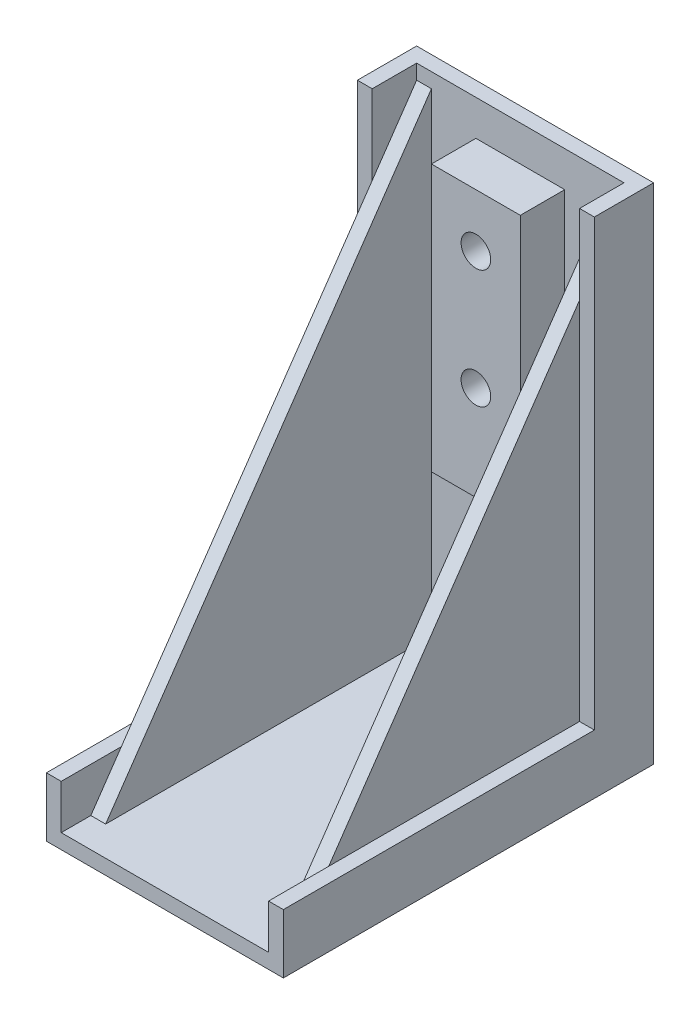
ISO-10303-21;
HEADER;
FILE_DESCRIPTION(('STEP AP214'),'2;1');
FILE_NAME('part.step','',(''),(''),'','','');
FILE_SCHEMA(('AUTOMOTIVE_DESIGN { 1 0 10303 214 1 1 1 1 }'));
ENDSEC;
DATA;
#1=APPLICATION_CONTEXT('core data for automotive mechanical design processes');
#2=APPLICATION_PROTOCOL_DEFINITION('international standard','automotive_design',2000,#1);
#3=PRODUCT_CONTEXT('',#1,'mechanical');
#4=PRODUCT('Part','Part','',(#3));
#5=PRODUCT_RELATED_PRODUCT_CATEGORY('part','',(#4));
#6=PRODUCT_DEFINITION_FORMATION('','',#4);
#7=PRODUCT_DEFINITION_CONTEXT('part definition',#1,'design');
#8=PRODUCT_DEFINITION('design','',#6,#7);
#9=PRODUCT_DEFINITION_SHAPE('','',#8);
#10=(LENGTH_UNIT() NAMED_UNIT(*) SI_UNIT(.MILLI.,.METRE.));
#11=(NAMED_UNIT(*) PLANE_ANGLE_UNIT() SI_UNIT($,.RADIAN.));
#12=(NAMED_UNIT(*) SI_UNIT($,.STERADIAN.) SOLID_ANGLE_UNIT());
#13=UNCERTAINTY_MEASURE_WITH_UNIT(LENGTH_MEASURE(1.E-05),#10,'distance_accuracy_value','');
#14=(GEOMETRIC_REPRESENTATION_CONTEXT(3) GLOBAL_UNCERTAINTY_ASSIGNED_CONTEXT((#13)) GLOBAL_UNIT_ASSIGNED_CONTEXT((#10,
#11,#12)) REPRESENTATION_CONTEXT('',''));
#15=CARTESIAN_POINT('',(0.,0.,0.));
#16=DIRECTION('',(0.,0.,1.));
#17=DIRECTION('',(1.,0.,0.));
#18=AXIS2_PLACEMENT_3D('',#15,#16,#17);
#19=CARTESIAN_POINT('',(8.75,41.25,0.));
#20=DIRECTION('',(0.,0.,-1.));
#21=DIRECTION('',(0.,1.,0.));
#22=AXIS2_PLACEMENT_3D('',#19,#20,#21);
#23=PLANE('',#22);
#24=DIRECTION('',(1.,0.,0.));
#25=VECTOR('',#24,1.);
#26=CARTESIAN_POINT('',(7.5,40.,0.));
#27=LINE('',#26,#25);
#28=CARTESIAN_POINT('',(7.5,40.,0.));
#29=VERTEX_POINT('',#28);
#30=CARTESIAN_POINT('',(8.75,40.,0.));
#31=VERTEX_POINT('',#30);
#32=EDGE_CURVE('E216',#29,#31,#27,.T.);
#33=ORIENTED_EDGE('',*,*,#32,.T.);
#34=DIRECTION('',(0.,-1.,0.));
#35=VECTOR('',#34,1.);
#36=CARTESIAN_POINT('',(8.75,41.25,0.));
#37=LINE('',#36,#35);
#38=CARTESIAN_POINT('',(8.75,41.25,0.));
#39=VERTEX_POINT('',#38);
#40=EDGE_CURVE('E315',#39,#31,#37,.T.);
#41=ORIENTED_EDGE('',*,*,#40,.F.);
#42=DIRECTION('',(-1.,0.,0.));
#43=VECTOR('',#42,1.);
#44=CARTESIAN_POINT('',(8.75,41.25,0.));
#45=LINE('',#44,#43);
#46=CARTESIAN_POINT('',(-8.75,41.25,0.));
#47=VERTEX_POINT('',#46);
#48=EDGE_CURVE('E321',#39,#47,#45,.T.);
#49=ORIENTED_EDGE('',*,*,#48,.T.);
#50=DIRECTION('',(0.,-1.,0.));
#51=VECTOR('',#50,1.);
#52=CARTESIAN_POINT('',(-8.75,41.25,0.));
#53=LINE('',#52,#51);
#54=CARTESIAN_POINT('',(-8.75,40.,0.));
#55=VERTEX_POINT('',#54);
#56=EDGE_CURVE('E314',#47,#55,#53,.T.);
#57=ORIENTED_EDGE('',*,*,#56,.T.);
#58=DIRECTION('',(-1.,0.,0.));
#59=VECTOR('',#58,1.);
#60=CARTESIAN_POINT('',(-7.5,40.,0.));
#61=LINE('',#60,#59);
#62=CARTESIAN_POINT('',(-7.5,40.,0.));
#63=VERTEX_POINT('',#62);
#64=EDGE_CURVE('E237',#63,#55,#61,.T.);
#65=ORIENTED_EDGE('',*,*,#64,.F.);
#66=DIRECTION('',(0.,1.,0.));
#67=VECTOR('',#66,1.);
#68=CARTESIAN_POINT('',(-7.5,0.,0.));
#69=LINE('',#68,#67);
#70=CARTESIAN_POINT('',(-7.5,0.,0.));
#71=VERTEX_POINT('',#70);
#72=EDGE_CURVE('E227',#71,#63,#69,.T.);
#73=ORIENTED_EDGE('',*,*,#72,.F.);
#74=DIRECTION('',(-1.,0.,0.));
#75=VECTOR('',#74,1.);
#76=CARTESIAN_POINT('',(8.75,0.,0.));
#77=LINE('',#76,#75);
#78=CARTESIAN_POINT('',(7.5,0.,0.));
#79=VERTEX_POINT('',#78);
#80=EDGE_CURVE('E39',#79,#71,#77,.T.);
#81=ORIENTED_EDGE('',*,*,#80,.F.);
#82=DIRECTION('',(0.,-1.,0.));
#83=VECTOR('',#82,1.);
#84=CARTESIAN_POINT('',(7.5,0.,0.));
#85=LINE('',#84,#83);
#86=EDGE_CURVE('E215',#29,#79,#85,.T.);
#87=ORIENTED_EDGE('',*,*,#86,.F.);
#88=EDGE_LOOP('',(#33,#41,#49,#57,#65,#73,#81,#87));
#89=FACE_BOUND('',#88,.T.);
#90=DIRECTION('',(0.,-1.,0.));
#91=VECTOR('',#90,1.);
#92=CARTESIAN_POINT('',(-3.75,38.25,0.));
#93=LINE('',#92,#91);
#94=CARTESIAN_POINT('',(-3.75,38.25,0.));
#95=VERTEX_POINT('',#94);
#96=CARTESIAN_POINT('',(-3.75,15.75,0.));
#97=VERTEX_POINT('',#96);
#98=EDGE_CURVE('E200',#95,#97,#93,.T.);
#99=ORIENTED_EDGE('',*,*,#98,.F.);
#100=DIRECTION('',(-1.,0.,0.));
#101=VECTOR('',#100,1.);
#102=CARTESIAN_POINT('',(-3.75,38.25,0.));
#103=LINE('',#102,#101);
#104=CARTESIAN_POINT('',(3.75,38.25,0.));
#105=VERTEX_POINT('',#104);
#106=EDGE_CURVE('E197',#105,#95,#103,.T.);
#107=ORIENTED_EDGE('',*,*,#106,.F.);
#108=DIRECTION('',(0.,1.,0.));
#109=VECTOR('',#108,1.);
#110=CARTESIAN_POINT('',(3.75,38.25,0.));
#111=LINE('',#110,#109);
#112=CARTESIAN_POINT('',(3.75,15.75,0.));
#113=VERTEX_POINT('',#112);
#114=EDGE_CURVE('E51',#113,#105,#111,.T.);
#115=ORIENTED_EDGE('',*,*,#114,.F.);
#116=DIRECTION('',(1.,0.,0.));
#117=VECTOR('',#116,1.);
#118=CARTESIAN_POINT('',(-3.75,15.75,0.));
#119=LINE('',#118,#117);
#120=EDGE_CURVE('E46',#97,#113,#119,.T.);
#121=ORIENTED_EDGE('',*,*,#120,.F.);
#122=EDGE_LOOP('',(#99,#107,#115,#121));
#123=FACE_BOUND('',#122,.T.);
#124=ADVANCED_FACE('F32',(#89,#123),#23,.F.);
#125=CARTESIAN_POINT('',(8.75,0.,0.));
#126=DIRECTION('',(0.,-1.,0.));
#127=DIRECTION('',(0.,0.,-1.));
#128=AXIS2_PLACEMENT_3D('',#125,#126,#127);
#129=PLANE('',#128);
#130=DIRECTION('',(1.,0.,0.));
#131=VECTOR('',#130,1.);
#132=CARTESIAN_POINT('',(7.5,0.,27.5));
#133=LINE('',#132,#131);
#134=CARTESIAN_POINT('',(7.5,0.,27.5));
#135=VERTEX_POINT('',#134);
#136=CARTESIAN_POINT('',(8.75,0.,27.5));
#137=VERTEX_POINT('',#136);
#138=EDGE_CURVE('E221',#135,#137,#133,.T.);
#139=ORIENTED_EDGE('',*,*,#138,.F.);
#140=DIRECTION('',(0.,0.,1.));
#141=VECTOR('',#140,1.);
#142=CARTESIAN_POINT('',(7.5,0.,27.5));
#143=LINE('',#142,#141);
#144=EDGE_CURVE('E210',#79,#135,#143,.T.);
#145=ORIENTED_EDGE('',*,*,#144,.F.);
#146=ORIENTED_EDGE('',*,*,#80,.T.);
#147=DIRECTION('',(0.,0.,-1.));
#148=VECTOR('',#147,1.);
#149=CARTESIAN_POINT('',(-7.5,0.,27.5));
#150=LINE('',#149,#148);
#151=CARTESIAN_POINT('',(-7.5,0.,27.5));
#152=VERTEX_POINT('',#151);
#153=EDGE_CURVE('E224',#152,#71,#150,.T.);
#154=ORIENTED_EDGE('',*,*,#153,.F.);
#155=DIRECTION('',(-1.,0.,0.));
#156=VECTOR('',#155,1.);
#157=CARTESIAN_POINT('',(-7.5,0.,27.5));
#158=LINE('',#157,#156);
#159=CARTESIAN_POINT('',(-8.75,0.,27.5));
#160=VERTEX_POINT('',#159);
#161=EDGE_CURVE('E232',#152,#160,#158,.T.);
#162=ORIENTED_EDGE('',*,*,#161,.T.);
#163=DIRECTION('',(0.,0.,1.));
#164=VECTOR('',#163,1.);
#165=CARTESIAN_POINT('',(-8.75,0.,0.));
#166=LINE('',#165,#164);
#167=CARTESIAN_POINT('',(-8.75,0.,30.));
#168=VERTEX_POINT('',#167);
#169=EDGE_CURVE('E319',#160,#168,#166,.T.);
#170=ORIENTED_EDGE('',*,*,#169,.T.);
#171=DIRECTION('',(-1.,0.,0.));
#172=VECTOR('',#171,1.);
#173=CARTESIAN_POINT('',(8.75,0.,30.));
#174=LINE('',#173,#172);
#175=CARTESIAN_POINT('',(8.75,0.,30.));
#176=VERTEX_POINT('',#175);
#177=EDGE_CURVE('E333',#176,#168,#174,.T.);
#178=ORIENTED_EDGE('',*,*,#177,.F.);
#179=DIRECTION('',(0.,0.,1.));
#180=VECTOR('',#179,1.);
#181=CARTESIAN_POINT('',(8.75,0.,0.));
#182=LINE('',#181,#180);
#183=EDGE_CURVE('E318',#137,#176,#182,.T.);
#184=ORIENTED_EDGE('',*,*,#183,.F.);
#185=EDGE_LOOP('',(#139,#145,#146,#154,#162,#170,#178,#184));
#186=FACE_BOUND('',#185,.T.);
#187=ADVANCED_FACE('F340',(#186),#129,.F.);
#188=CARTESIAN_POINT('',(8.75,0.,0.));
#189=DIRECTION('',(-1.,0.,0.));
#190=DIRECTION('',(0.,0.,1.));
#191=AXIS2_PLACEMENT_3D('',#188,#189,#190);
#192=PLANE('',#191);
#193=ORIENTED_EDGE('',*,*,#40,.T.);
#194=DIRECTION('',(0.,-0.824041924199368,0.566528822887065));
#195=VECTOR('',#194,1.);
#196=CARTESIAN_POINT('',(8.75,12.8381962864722,18.6737400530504));
#197=LINE('',#196,#195);
#198=CARTESIAN_POINT('',(8.75,34.5454545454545,3.75000000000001));
#199=VERTEX_POINT('',#198);
#200=EDGE_CURVE('E11',#31,#199,#197,.T.);
#201=ORIENTED_EDGE('',*,*,#200,.T.);
#202=DIRECTION('',(0.,-1.,0.));
#203=VECTOR('',#202,1.);
#204=CARTESIAN_POINT('',(8.75,3.75,3.75000000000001));
#205=LINE('',#204,#203);
#206=CARTESIAN_POINT('',(8.75,41.25,3.75000000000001));
#207=VERTEX_POINT('',#206);
#208=EDGE_CURVE('E300',#207,#199,#205,.T.);
#209=ORIENTED_EDGE('',*,*,#208,.F.);
#210=DIRECTION('',(0.,0.,1.));
#211=VECTOR('',#210,1.);
#212=CARTESIAN_POINT('',(8.75,41.25,3.75000000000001));
#213=LINE('',#212,#211);
#214=EDGE_CURVE('E297',#39,#207,#213,.T.);
#215=ORIENTED_EDGE('',*,*,#214,.F.);
#216=EDGE_LOOP('',(#193,#201,#209,#215));
#217=FACE_BOUND('',#216,.T.);
#218=ADVANCED_FACE('F395',(#217),#192,.T.);
#219=DIRECTION('',(0.,0.,1.));
#220=VECTOR('',#219,1.);
#221=CARTESIAN_POINT('',(8.75,3.75,30.));
#222=LINE('',#221,#220);
#223=CARTESIAN_POINT('',(8.75,3.75,24.921875));
#224=VERTEX_POINT('',#223);
#225=CARTESIAN_POINT('',(8.75,3.75,30.));
#226=VERTEX_POINT('',#225);
#227=EDGE_CURVE('E303',#224,#226,#222,.T.);
#228=ORIENTED_EDGE('',*,*,#227,.F.);
#229=DIRECTION('',(0.,0.824041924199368,-0.566528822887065));
#230=VECTOR('',#229,1.);
#231=CARTESIAN_POINT('',(8.75,40.,0.));
#232=LINE('',#231,#230);
#233=EDGE_CURVE('E204',#137,#224,#232,.T.);
#234=ORIENTED_EDGE('',*,*,#233,.F.);
#235=ORIENTED_EDGE('',*,*,#183,.T.);
#236=DIRECTION('',(0.,-1.,0.));
#237=VECTOR('',#236,1.);
#238=CARTESIAN_POINT('',(8.75,-1.25,30.));
#239=LINE('',#238,#237);
#240=EDGE_CURVE('E277',#226,#176,#239,.T.);
#241=ORIENTED_EDGE('',*,*,#240,.F.);
#242=EDGE_LOOP('',(#228,#234,#235,#241));
#243=FACE_BOUND('',#242,.T.);
#244=ADVANCED_FACE('F385',(#243),#192,.T.);
#245=CARTESIAN_POINT('',(-8.75,0.,0.));
#246=DIRECTION('',(1.,0.,0.));
#247=DIRECTION('',(0.,0.,-1.));
#248=AXIS2_PLACEMENT_3D('',#245,#246,#247);
#249=PLANE('',#248);
#250=ORIENTED_EDGE('',*,*,#169,.F.);
#251=DIRECTION('',(0.,-0.824041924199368,0.566528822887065));
#252=VECTOR('',#251,1.);
#253=CARTESIAN_POINT('',(-8.75,40.,0.));
#254=LINE('',#253,#252);
#255=CARTESIAN_POINT('',(-8.75,3.75,24.921875));
#256=VERTEX_POINT('',#255);
#257=EDGE_CURVE('E223',#256,#160,#254,.T.);
#258=ORIENTED_EDGE('',*,*,#257,.F.);
#259=DIRECTION('',(0.,0.,-1.));
#260=VECTOR('',#259,1.);
#261=CARTESIAN_POINT('',(-8.75,3.75,3.75000000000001));
#262=LINE('',#261,#260);
#263=CARTESIAN_POINT('',(-8.75,3.75,30.));
#264=VERTEX_POINT('',#263);
#265=EDGE_CURVE('E260',#264,#256,#262,.T.);
#266=ORIENTED_EDGE('',*,*,#265,.F.);
#267=DIRECTION('',(0.,1.,0.));
#268=VECTOR('',#267,1.);
#269=CARTESIAN_POINT('',(-8.75,3.75,30.));
#270=LINE('',#269,#268);
#271=EDGE_CURVE('E241',#168,#264,#270,.T.);
#272=ORIENTED_EDGE('',*,*,#271,.F.);
#273=EDGE_LOOP('',(#250,#258,#266,#272));
#274=FACE_BOUND('',#273,.T.);
#275=ADVANCED_FACE('F375',(#274),#249,.T.);
#276=DIRECTION('',(0.,1.,0.));
#277=VECTOR('',#276,1.);
#278=CARTESIAN_POINT('',(-8.75,41.25,3.75000000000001));
#279=LINE('',#278,#277);
#280=CARTESIAN_POINT('',(-8.75,34.5454545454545,3.75000000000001));
#281=VERTEX_POINT('',#280);
#282=CARTESIAN_POINT('',(-8.75,41.25,3.75000000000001));
#283=VERTEX_POINT('',#282);
#284=EDGE_CURVE('E263',#281,#283,#279,.T.);
#285=ORIENTED_EDGE('',*,*,#284,.F.);
#286=EDGE_CURVE('E228',#55,#281,#254,.T.);
#287=ORIENTED_EDGE('',*,*,#286,.F.);
#288=ORIENTED_EDGE('',*,*,#56,.F.);
#289=DIRECTION('',(0.,0.,-1.));
#290=VECTOR('',#289,1.);
#291=CARTESIAN_POINT('',(-8.75,41.25,-1.24999999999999));
#292=LINE('',#291,#290);
#293=EDGE_CURVE('E245',#283,#47,#292,.T.);
#294=ORIENTED_EDGE('',*,*,#293,.F.);
#295=EDGE_LOOP('',(#285,#287,#288,#294));
#296=FACE_BOUND('',#295,.T.);
#297=ADVANCED_FACE('F356',(#296),#249,.T.);
#298=CARTESIAN_POINT('',(8.75,0.,30.));
#299=DIRECTION('',(0.,0.,-1.));
#300=DIRECTION('',(-1.,0.,0.));
#301=AXIS2_PLACEMENT_3D('',#298,#299,#300);
#302=PLANE('',#301);
#303=ORIENTED_EDGE('',*,*,#177,.T.);
#304=ORIENTED_EDGE('',*,*,#271,.T.);
#305=DIRECTION('',(1.,0.,0.));
#306=VECTOR('',#305,1.);
#307=CARTESIAN_POINT('',(-10.,3.75,30.));
#308=LINE('',#307,#306);
#309=CARTESIAN_POINT('',(-10.,3.75,30.));
#310=VERTEX_POINT('',#309);
#311=EDGE_CURVE('E274',#310,#264,#308,.T.);
#312=ORIENTED_EDGE('',*,*,#311,.F.);
#313=DIRECTION('',(0.,1.,0.));
#314=VECTOR('',#313,1.);
#315=CARTESIAN_POINT('',(-10.,0.,30.));
#316=LINE('',#315,#314);
#317=CARTESIAN_POINT('',(-10.,-1.25,30.));
#318=VERTEX_POINT('',#317);
#319=EDGE_CURVE('E242',#318,#310,#316,.T.);
#320=ORIENTED_EDGE('',*,*,#319,.F.);
#321=DIRECTION('',(-1.,0.,0.));
#322=VECTOR('',#321,1.);
#323=CARTESIAN_POINT('',(8.75,-1.25,30.));
#324=LINE('',#323,#322);
#325=CARTESIAN_POINT('',(10.,-1.25,30.));
#326=VERTEX_POINT('',#325);
#327=EDGE_CURVE('E331',#326,#318,#324,.T.);
#328=ORIENTED_EDGE('',*,*,#327,.F.);
#329=DIRECTION('',(0.,-1.,0.));
#330=VECTOR('',#329,1.);
#331=CARTESIAN_POINT('',(10.,-1.25,30.));
#332=LINE('',#331,#330);
#333=CARTESIAN_POINT('',(10.,3.75,30.));
#334=VERTEX_POINT('',#333);
#335=EDGE_CURVE('E278',#334,#326,#332,.T.);
#336=ORIENTED_EDGE('',*,*,#335,.F.);
#337=DIRECTION('',(-1.,0.,0.));
#338=VECTOR('',#337,1.);
#339=CARTESIAN_POINT('',(10.,3.75,30.));
#340=LINE('',#339,#338);
#341=EDGE_CURVE('E294',#334,#226,#340,.T.);
#342=ORIENTED_EDGE('',*,*,#341,.T.);
#343=ORIENTED_EDGE('',*,*,#240,.T.);
#344=EDGE_LOOP('',(#303,#304,#312,#320,#328,#336,#342,#343));
#345=FACE_BOUND('',#344,.T.);
#346=ADVANCED_FACE('F380',(#345),#302,.F.);
#347=CARTESIAN_POINT('',(8.75,-1.25,30.));
#348=DIRECTION('',(0.,1.,0.));
#349=DIRECTION('',(0.,0.,1.));
#350=AXIS2_PLACEMENT_3D('',#347,#348,#349);
#351=PLANE('',#350);
#352=ORIENTED_EDGE('',*,*,#327,.T.);
#353=DIRECTION('',(0.,0.,1.));
#354=VECTOR('',#353,1.);
#355=CARTESIAN_POINT('',(-10.,-1.25,30.));
#356=LINE('',#355,#354);
#357=CARTESIAN_POINT('',(-10.,-1.25,-1.25));
#358=VERTEX_POINT('',#357);
#359=EDGE_CURVE('E255',#358,#318,#356,.T.);
#360=ORIENTED_EDGE('',*,*,#359,.F.);
#361=DIRECTION('',(-1.,0.,0.));
#362=VECTOR('',#361,1.);
#363=CARTESIAN_POINT('',(8.75,-1.25,-1.25));
#364=LINE('',#363,#362);
#365=CARTESIAN_POINT('',(10.,-1.25,-1.25));
#366=VERTEX_POINT('',#365);
#367=EDGE_CURVE('E329',#366,#358,#364,.T.);
#368=ORIENTED_EDGE('',*,*,#367,.F.);
#369=DIRECTION('',(0.,0.,-1.));
#370=VECTOR('',#369,1.);
#371=CARTESIAN_POINT('',(10.,-1.25,30.));
#372=LINE('',#371,#370);
#373=EDGE_CURVE('E281',#326,#366,#372,.T.);
#374=ORIENTED_EDGE('',*,*,#373,.F.);
#375=EDGE_LOOP('',(#352,#360,#368,#374));
#376=FACE_BOUND('',#375,.T.);
#377=ADVANCED_FACE('F419',(#376),#351,.F.);
#378=CARTESIAN_POINT('',(8.75,-1.25,-1.25));
#379=DIRECTION('',(0.,0.,1.));
#380=DIRECTION('',(0.,-1.,0.));
#381=AXIS2_PLACEMENT_3D('',#378,#379,#380);
#382=PLANE('',#381);
#383=CARTESIAN_POINT('',(0.,33.75,-1.25));
#384=DIRECTION('',(0.,0.,1.));
#385=DIRECTION('',(1.,0.,0.));
#386=AXIS2_PLACEMENT_3D('',#383,#384,#385);
#387=CIRCLE('',#386,1.25);
#388=CARTESIAN_POINT('',(1.25,33.75,-1.25));
#389=VERTEX_POINT('',#388);
#390=EDGE_CURVE('E696',#389,#389,#387,.T.);
#391=ORIENTED_EDGE('',*,*,#390,.T.);
#392=EDGE_LOOP('',(#391));
#393=FACE_BOUND('',#392,.T.);
#394=CARTESIAN_POINT('',(0.,23.75,-1.25));
#395=DIRECTION('',(0.,0.,1.));
#396=DIRECTION('',(1.,0.,0.));
#397=AXIS2_PLACEMENT_3D('',#394,#395,#396);
#398=CIRCLE('',#397,1.25);
#399=CARTESIAN_POINT('',(1.25,23.75,-1.25));
#400=VERTEX_POINT('',#399);
#401=EDGE_CURVE('E700',#400,#400,#398,.T.);
#402=ORIENTED_EDGE('',*,*,#401,.T.);
#403=EDGE_LOOP('',(#402));
#404=FACE_BOUND('',#403,.T.);
#405=ORIENTED_EDGE('',*,*,#367,.T.);
#406=DIRECTION('',(0.,-1.,0.));
#407=VECTOR('',#406,1.);
#408=CARTESIAN_POINT('',(-10.,-1.25,-1.25));
#409=LINE('',#408,#407);
#410=CARTESIAN_POINT('',(-10.,41.25,-1.24999999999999));
#411=VERTEX_POINT('',#410);
#412=EDGE_CURVE('E252',#411,#358,#409,.T.);
#413=ORIENTED_EDGE('',*,*,#412,.F.);
#414=DIRECTION('',(-1.,0.,0.));
#415=VECTOR('',#414,1.);
#416=CARTESIAN_POINT('',(8.75,41.25,-1.24999999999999));
#417=LINE('',#416,#415);
#418=CARTESIAN_POINT('',(10.,41.25,-1.24999999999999));
#419=VERTEX_POINT('',#418);
#420=EDGE_CURVE('E327',#419,#411,#417,.T.);
#421=ORIENTED_EDGE('',*,*,#420,.F.);
#422=DIRECTION('',(0.,1.,0.));
#423=VECTOR('',#422,1.);
#424=CARTESIAN_POINT('',(10.,-1.25,-1.25));
#425=LINE('',#424,#423);
#426=EDGE_CURVE('E285',#366,#419,#425,.T.);
#427=ORIENTED_EDGE('',*,*,#426,.F.);
#428=EDGE_LOOP('',(#405,#413,#421,#427));
#429=FACE_BOUND('',#428,.T.);
#430=ADVANCED_FACE('F416',(#393,#404,#429),#382,.F.);
#431=CARTESIAN_POINT('',(8.75,41.25,-1.24999999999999));
#432=DIRECTION('',(0.,-1.,0.));
#433=DIRECTION('',(0.,0.,-1.));
#434=AXIS2_PLACEMENT_3D('',#431,#432,#433);
#435=PLANE('',#434);
#436=ORIENTED_EDGE('',*,*,#420,.T.);
#437=DIRECTION('',(0.,0.,-1.));
#438=VECTOR('',#437,1.);
#439=CARTESIAN_POINT('',(-10.,41.25,0.));
#440=LINE('',#439,#438);
#441=CARTESIAN_POINT('',(-10.,41.25,3.75000000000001));
#442=VERTEX_POINT('',#441);
#443=EDGE_CURVE('E249',#442,#411,#440,.T.);
#444=ORIENTED_EDGE('',*,*,#443,.F.);
#445=DIRECTION('',(1.,0.,0.));
#446=VECTOR('',#445,1.);
#447=CARTESIAN_POINT('',(-10.,41.25,3.75000000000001));
#448=LINE('',#447,#446);
#449=EDGE_CURVE('E258',#442,#283,#448,.T.);
#450=ORIENTED_EDGE('',*,*,#449,.T.);
#451=ORIENTED_EDGE('',*,*,#293,.T.);
#452=ORIENTED_EDGE('',*,*,#48,.F.);
#453=ORIENTED_EDGE('',*,*,#214,.T.);
#454=DIRECTION('',(-1.,0.,0.));
#455=VECTOR('',#454,1.);
#456=CARTESIAN_POINT('',(10.,41.25,3.75000000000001));
#457=LINE('',#456,#455);
#458=CARTESIAN_POINT('',(10.,41.25,3.75000000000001));
#459=VERTEX_POINT('',#458);
#460=EDGE_CURVE('E311',#459,#207,#457,.T.);
#461=ORIENTED_EDGE('',*,*,#460,.F.);
#462=DIRECTION('',(0.,0.,1.));
#463=VECTOR('',#462,1.);
#464=CARTESIAN_POINT('',(10.,41.25,3.75000000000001));
#465=LINE('',#464,#463);
#466=EDGE_CURVE('E288',#419,#459,#465,.T.);
#467=ORIENTED_EDGE('',*,*,#466,.F.);
#468=EDGE_LOOP('',(#436,#444,#450,#451,#452,#453,#461,#467));
#469=FACE_BOUND('',#468,.T.);
#470=ADVANCED_FACE('F399',(#469),#435,.F.);
#471=CARTESIAN_POINT('',(10.,3.75,3.75000000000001));
#472=DIRECTION('',(0.,0.,-1.));
#473=DIRECTION('',(0.,1.,0.));
#474=AXIS2_PLACEMENT_3D('',#471,#472,#473);
#475=PLANE('',#474);
#476=ORIENTED_EDGE('',*,*,#208,.T.);
#477=CARTESIAN_POINT('',(8.75,3.75,3.75000000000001));
#478=VERTEX_POINT('',#477);
#479=EDGE_CURVE('E299',#199,#478,#205,.T.);
#480=ORIENTED_EDGE('',*,*,#479,.T.);
#481=DIRECTION('',(-1.,0.,0.));
#482=VECTOR('',#481,1.);
#483=CARTESIAN_POINT('',(10.,3.75,3.75000000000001));
#484=LINE('',#483,#482);
#485=CARTESIAN_POINT('',(10.,3.75,3.75000000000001));
#486=VERTEX_POINT('',#485);
#487=EDGE_CURVE('E308',#486,#478,#484,.T.);
#488=ORIENTED_EDGE('',*,*,#487,.F.);
#489=DIRECTION('',(0.,-1.,0.));
#490=VECTOR('',#489,1.);
#491=CARTESIAN_POINT('',(10.,3.75,3.75000000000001));
#492=LINE('',#491,#490);
#493=EDGE_CURVE('E290',#459,#486,#492,.T.);
#494=ORIENTED_EDGE('',*,*,#493,.F.);
#495=ORIENTED_EDGE('',*,*,#460,.T.);
#496=EDGE_LOOP('',(#476,#480,#488,#494,#495));
#497=FACE_BOUND('',#496,.T.);
#498=ADVANCED_FACE('F403',(#497),#475,.F.);
#499=CARTESIAN_POINT('',(10.,3.75,30.));
#500=DIRECTION('',(0.,-1.,0.));
#501=DIRECTION('',(0.,0.,-1.));
#502=AXIS2_PLACEMENT_3D('',#499,#500,#501);
#503=PLANE('',#502);
#504=EDGE_CURVE('E282',#478,#224,#222,.T.);
#505=ORIENTED_EDGE('',*,*,#504,.T.);
#506=ORIENTED_EDGE('',*,*,#227,.T.);
#507=ORIENTED_EDGE('',*,*,#341,.F.);
#508=DIRECTION('',(0.,0.,1.));
#509=VECTOR('',#508,1.);
#510=CARTESIAN_POINT('',(10.,3.75,30.));
#511=LINE('',#510,#509);
#512=EDGE_CURVE('E292',#486,#334,#511,.T.);
#513=ORIENTED_EDGE('',*,*,#512,.F.);
#514=ORIENTED_EDGE('',*,*,#487,.T.);
#515=EDGE_LOOP('',(#505,#506,#507,#513,#514));
#516=FACE_BOUND('',#515,.T.);
#517=ADVANCED_FACE('F444',(#516),#503,.F.);
#518=CARTESIAN_POINT('',(10.,0.,0.));
#519=DIRECTION('',(-1.,0.,0.));
#520=DIRECTION('',(0.,0.,1.));
#521=AXIS2_PLACEMENT_3D('',#518,#519,#520);
#522=PLANE('',#521);
#523=ORIENTED_EDGE('',*,*,#335,.T.);
#524=ORIENTED_EDGE('',*,*,#373,.T.);
#525=ORIENTED_EDGE('',*,*,#426,.T.);
#526=ORIENTED_EDGE('',*,*,#466,.T.);
#527=ORIENTED_EDGE('',*,*,#493,.T.);
#528=ORIENTED_EDGE('',*,*,#512,.T.);
#529=EDGE_LOOP('',(#523,#524,#525,#526,#527,#528));
#530=FACE_BOUND('',#529,.T.);
#531=ADVANCED_FACE('F408',(#530),#522,.F.);
#532=CARTESIAN_POINT('',(-10.,3.75,3.75000000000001));
#533=DIRECTION('',(0.,-1.,0.));
#534=DIRECTION('',(0.,0.,-1.));
#535=AXIS2_PLACEMENT_3D('',#532,#533,#534);
#536=PLANE('',#535);
#537=ORIENTED_EDGE('',*,*,#265,.T.);
#538=DIRECTION('',(0.,0.,1.));
#539=VECTOR('',#538,1.);
#540=CARTESIAN_POINT('',(-8.75,3.75,3.75000000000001));
#541=LINE('',#540,#539);
#542=CARTESIAN_POINT('',(-8.75,3.75,3.75000000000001));
#543=VERTEX_POINT('',#542);
#544=EDGE_CURVE('E239',#543,#256,#541,.T.);
#545=ORIENTED_EDGE('',*,*,#544,.F.);
#546=DIRECTION('',(1.,0.,0.));
#547=VECTOR('',#546,1.);
#548=CARTESIAN_POINT('',(-10.,3.75,3.75000000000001));
#549=LINE('',#548,#547);
#550=CARTESIAN_POINT('',(-10.,3.75,3.75000000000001));
#551=VERTEX_POINT('',#550);
#552=EDGE_CURVE('E271',#551,#543,#549,.T.);
#553=ORIENTED_EDGE('',*,*,#552,.F.);
#554=DIRECTION('',(0.,0.,-1.));
#555=VECTOR('',#554,1.);
#556=CARTESIAN_POINT('',(-10.,3.75,3.75000000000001));
#557=LINE('',#556,#555);
#558=EDGE_CURVE('E244',#310,#551,#557,.T.);
#559=ORIENTED_EDGE('',*,*,#558,.F.);
#560=ORIENTED_EDGE('',*,*,#311,.T.);
#561=EDGE_LOOP('',(#537,#545,#553,#559,#560));
#562=FACE_BOUND('',#561,.T.);
#563=ADVANCED_FACE('F367',(#562),#536,.F.);
#564=CARTESIAN_POINT('',(-10.,41.25,3.75000000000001));
#565=DIRECTION('',(0.,0.,-1.));
#566=DIRECTION('',(0.,1.,0.));
#567=AXIS2_PLACEMENT_3D('',#564,#565,#566);
#568=PLANE('',#567);
#569=EDGE_CURVE('E264',#543,#281,#279,.T.);
#570=ORIENTED_EDGE('',*,*,#569,.T.);
#571=ORIENTED_EDGE('',*,*,#284,.T.);
#572=ORIENTED_EDGE('',*,*,#449,.F.);
#573=DIRECTION('',(0.,1.,0.));
#574=VECTOR('',#573,1.);
#575=CARTESIAN_POINT('',(-10.,41.25,3.75000000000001));
#576=LINE('',#575,#574);
#577=EDGE_CURVE('E247',#551,#442,#576,.T.);
#578=ORIENTED_EDGE('',*,*,#577,.F.);
#579=ORIENTED_EDGE('',*,*,#552,.T.);
#580=EDGE_LOOP('',(#570,#571,#572,#578,#579));
#581=FACE_BOUND('',#580,.T.);
#582=ADVANCED_FACE('F360',(#581),#568,.F.);
#583=CARTESIAN_POINT('',(-10.,0.,0.));
#584=DIRECTION('',(1.,0.,0.));
#585=DIRECTION('',(0.,0.,-1.));
#586=AXIS2_PLACEMENT_3D('',#583,#584,#585);
#587=PLANE('',#586);
#588=ORIENTED_EDGE('',*,*,#319,.T.);
#589=ORIENTED_EDGE('',*,*,#558,.T.);
#590=ORIENTED_EDGE('',*,*,#577,.T.);
#591=ORIENTED_EDGE('',*,*,#443,.T.);
#592=ORIENTED_EDGE('',*,*,#412,.T.);
#593=ORIENTED_EDGE('',*,*,#359,.T.);
#594=EDGE_LOOP('',(#588,#589,#590,#591,#592,#593));
#595=FACE_BOUND('',#594,.T.);
#596=ADVANCED_FACE('F414',(#595),#587,.F.);
#597=CARTESIAN_POINT('',(-8.75,0.,0.));
#598=DIRECTION('',(1.,0.,0.));
#599=DIRECTION('',(0.,0.,-1.));
#600=AXIS2_PLACEMENT_3D('',#597,#598,#599);
#601=PLANE('',#600);
#602=ORIENTED_EDGE('',*,*,#569,.F.);
#603=ORIENTED_EDGE('',*,*,#544,.T.);
#604=EDGE_CURVE('E234',#281,#256,#254,.T.);
#605=ORIENTED_EDGE('',*,*,#604,.F.);
#606=EDGE_LOOP('',(#602,#603,#605));
#607=FACE_BOUND('',#606,.T.);
#608=ADVANCED_FACE('F365',(#607),#601,.F.);
#609=CARTESIAN_POINT('',(-7.5,40.,0.));
#610=DIRECTION('',(0.,-0.566528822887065,-0.824041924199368));
#611=DIRECTION('',(0.,0.824041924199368,-0.566528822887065));
#612=AXIS2_PLACEMENT_3D('',#609,#610,#611);
#613=PLANE('',#612);
#614=ORIENTED_EDGE('',*,*,#286,.T.);
#615=ORIENTED_EDGE('',*,*,#604,.T.);
#616=ORIENTED_EDGE('',*,*,#257,.T.);
#617=ORIENTED_EDGE('',*,*,#161,.F.);
#618=DIRECTION('',(0.,-0.824041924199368,0.566528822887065));
#619=VECTOR('',#618,1.);
#620=CARTESIAN_POINT('',(-7.5,40.,0.));
#621=LINE('',#620,#619);
#622=EDGE_CURVE('E230',#63,#152,#621,.T.);
#623=ORIENTED_EDGE('',*,*,#622,.F.);
#624=ORIENTED_EDGE('',*,*,#64,.T.);
#625=EDGE_LOOP('',(#614,#615,#616,#617,#623,#624));
#626=FACE_BOUND('',#625,.T.);
#627=ADVANCED_FACE('F351',(#626),#613,.F.);
#628=CARTESIAN_POINT('',(-7.5,0.,0.));
#629=DIRECTION('',(1.,0.,0.));
#630=DIRECTION('',(0.,0.,-1.));
#631=AXIS2_PLACEMENT_3D('',#628,#629,#630);
#632=PLANE('',#631);
#633=ORIENTED_EDGE('',*,*,#153,.T.);
#634=ORIENTED_EDGE('',*,*,#72,.T.);
#635=ORIENTED_EDGE('',*,*,#622,.T.);
#636=EDGE_LOOP('',(#633,#634,#635));
#637=FACE_BOUND('',#636,.T.);
#638=ADVANCED_FACE('F345',(#637),#632,.T.);
#639=CARTESIAN_POINT('',(8.75,0.,0.));
#640=DIRECTION('',(1.,0.,0.));
#641=DIRECTION('',(0.,0.,-1.));
#642=AXIS2_PLACEMENT_3D('',#639,#640,#641);
#643=PLANE('',#642);
#644=ORIENTED_EDGE('',*,*,#479,.F.);
#645=EDGE_CURVE('E201',#224,#199,#232,.T.);
#646=ORIENTED_EDGE('',*,*,#645,.F.);
#647=ORIENTED_EDGE('',*,*,#504,.F.);
#648=EDGE_LOOP('',(#644,#646,#647));
#649=FACE_BOUND('',#648,.T.);
#650=ADVANCED_FACE('F508',(#649),#643,.T.);
#651=CARTESIAN_POINT('',(7.5,40.,0.));
#652=DIRECTION('',(0.,-0.566528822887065,-0.824041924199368));
#653=DIRECTION('',(0.,0.824041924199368,-0.566528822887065));
#654=AXIS2_PLACEMENT_3D('',#651,#652,#653);
#655=PLANE('',#654);
#656=ORIENTED_EDGE('',*,*,#233,.T.);
#657=ORIENTED_EDGE('',*,*,#645,.T.);
#658=ORIENTED_EDGE('',*,*,#200,.F.);
#659=ORIENTED_EDGE('',*,*,#32,.F.);
#660=DIRECTION('',(0.,0.824041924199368,-0.566528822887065));
#661=VECTOR('',#660,1.);
#662=CARTESIAN_POINT('',(7.5,40.,0.));
#663=LINE('',#662,#661);
#664=EDGE_CURVE('E213',#135,#29,#663,.T.);
#665=ORIENTED_EDGE('',*,*,#664,.F.);
#666=ORIENTED_EDGE('',*,*,#138,.T.);
#667=EDGE_LOOP('',(#656,#657,#658,#659,#665,#666));
#668=FACE_BOUND('',#667,.T.);
#669=ADVANCED_FACE('F388',(#668),#655,.F.);
#670=CARTESIAN_POINT('',(7.5,0.,0.));
#671=DIRECTION('',(1.,0.,0.));
#672=DIRECTION('',(0.,0.,-1.));
#673=AXIS2_PLACEMENT_3D('',#670,#671,#672);
#674=PLANE('',#673);
#675=ORIENTED_EDGE('',*,*,#144,.T.);
#676=ORIENTED_EDGE('',*,*,#664,.T.);
#677=ORIENTED_EDGE('',*,*,#86,.T.);
#678=EDGE_LOOP('',(#675,#676,#677));
#679=FACE_BOUND('',#678,.T.);
#680=ADVANCED_FACE('F391',(#679),#674,.F.);
#681=CARTESIAN_POINT('',(-3.75,38.25,3.75));
#682=DIRECTION('',(1.,0.,0.));
#683=DIRECTION('',(0.,1.,0.));
#684=AXIS2_PLACEMENT_3D('',#681,#682,#683);
#685=PLANE('',#684);
#686=ORIENTED_EDGE('',*,*,#98,.T.);
#687=DIRECTION('',(0.,0.,-1.));
#688=VECTOR('',#687,1.);
#689=CARTESIAN_POINT('',(-3.75,15.75,3.75));
#690=LINE('',#689,#688);
#691=CARTESIAN_POINT('',(-3.75,15.75,3.75));
#692=VERTEX_POINT('',#691);
#693=EDGE_CURVE('E181',#692,#97,#690,.T.);
#694=ORIENTED_EDGE('',*,*,#693,.F.);
#695=DIRECTION('',(0.,-1.,0.));
#696=VECTOR('',#695,1.);
#697=CARTESIAN_POINT('',(-3.75,38.25,3.75));
#698=LINE('',#697,#696);
#699=CARTESIAN_POINT('',(-3.75,38.25,3.75));
#700=VERTEX_POINT('',#699);
#701=EDGE_CURVE('E188',#700,#692,#698,.T.);
#702=ORIENTED_EDGE('',*,*,#701,.F.);
#703=DIRECTION('',(0.,0.,-1.));
#704=VECTOR('',#703,1.);
#705=CARTESIAN_POINT('',(-3.75,38.25,3.75));
#706=LINE('',#705,#704);
#707=EDGE_CURVE('E711',#700,#95,#706,.T.);
#708=ORIENTED_EDGE('',*,*,#707,.T.);
#709=EDGE_LOOP('',(#686,#694,#702,#708));
#710=FACE_BOUND('',#709,.T.);
#711=ADVANCED_FACE('F199',(#710),#685,.F.);
#712=CARTESIAN_POINT('',(-3.75,15.75,3.75));
#713=DIRECTION('',(0.,1.,0.));
#714=DIRECTION('',(0.,0.,1.));
#715=AXIS2_PLACEMENT_3D('',#712,#713,#714);
#716=PLANE('',#715);
#717=ORIENTED_EDGE('',*,*,#120,.T.);
#718=DIRECTION('',(0.,0.,-1.));
#719=VECTOR('',#718,1.);
#720=CARTESIAN_POINT('',(3.75,15.75,3.75));
#721=LINE('',#720,#719);
#722=CARTESIAN_POINT('',(3.75,15.75,3.75));
#723=VERTEX_POINT('',#722);
#724=EDGE_CURVE('E184',#723,#113,#721,.T.);
#725=ORIENTED_EDGE('',*,*,#724,.F.);
#726=DIRECTION('',(1.,0.,0.));
#727=VECTOR('',#726,1.);
#728=CARTESIAN_POINT('',(-3.75,15.75,3.75));
#729=LINE('',#728,#727);
#730=EDGE_CURVE('E177',#692,#723,#729,.T.);
#731=ORIENTED_EDGE('',*,*,#730,.F.);
#732=ORIENTED_EDGE('',*,*,#693,.T.);
#733=EDGE_LOOP('',(#717,#725,#731,#732));
#734=FACE_BOUND('',#733,.T.);
#735=ADVANCED_FACE('F179',(#734),#716,.F.);
#736=CARTESIAN_POINT('',(3.75,38.25,3.75));
#737=DIRECTION('',(-1.,0.,0.));
#738=DIRECTION('',(0.,-1.,0.));
#739=AXIS2_PLACEMENT_3D('',#736,#737,#738);
#740=PLANE('',#739);
#741=ORIENTED_EDGE('',*,*,#114,.T.);
#742=DIRECTION('',(0.,0.,-1.));
#743=VECTOR('',#742,1.);
#744=CARTESIAN_POINT('',(3.75,38.25,3.75));
#745=LINE('',#744,#743);
#746=CARTESIAN_POINT('',(3.75,38.25,3.75));
#747=VERTEX_POINT('',#746);
#748=EDGE_CURVE('E206',#747,#105,#745,.T.);
#749=ORIENTED_EDGE('',*,*,#748,.F.);
#750=DIRECTION('',(0.,1.,0.));
#751=VECTOR('',#750,1.);
#752=CARTESIAN_POINT('',(3.75,38.25,3.75));
#753=LINE('',#752,#751);
#754=EDGE_CURVE('E187',#723,#747,#753,.T.);
#755=ORIENTED_EDGE('',*,*,#754,.F.);
#756=ORIENTED_EDGE('',*,*,#724,.T.);
#757=EDGE_LOOP('',(#741,#749,#755,#756));
#758=FACE_BOUND('',#757,.T.);
#759=ADVANCED_FACE('F539',(#758),#740,.F.);
#760=CARTESIAN_POINT('',(-3.75,38.25,3.75));
#761=DIRECTION('',(0.,-1.,0.));
#762=DIRECTION('',(0.,0.,-1.));
#763=AXIS2_PLACEMENT_3D('',#760,#761,#762);
#764=PLANE('',#763);
#765=ORIENTED_EDGE('',*,*,#106,.T.);
#766=ORIENTED_EDGE('',*,*,#707,.F.);
#767=DIRECTION('',(-1.,0.,0.));
#768=VECTOR('',#767,1.);
#769=CARTESIAN_POINT('',(-3.75,38.25,3.75));
#770=LINE('',#769,#768);
#771=EDGE_CURVE('E193',#747,#700,#770,.T.);
#772=ORIENTED_EDGE('',*,*,#771,.F.);
#773=ORIENTED_EDGE('',*,*,#748,.T.);
#774=EDGE_LOOP('',(#765,#766,#772,#773));
#775=FACE_BOUND('',#774,.T.);
#776=ADVANCED_FACE('F546',(#775),#764,.F.);
#777=CARTESIAN_POINT('',(0.,0.,3.75));
#778=DIRECTION('',(0.,0.,1.));
#779=DIRECTION('',(1.,0.,0.));
#780=AXIS2_PLACEMENT_3D('',#777,#778,#779);
#781=PLANE('',#780);
#782=CARTESIAN_POINT('',(0.,33.75,3.75));
#783=DIRECTION('',(0.,0.,1.));
#784=DIRECTION('',(1.,0.,0.));
#785=AXIS2_PLACEMENT_3D('',#782,#783,#784);
#786=CIRCLE('',#785,1.25);
#787=CARTESIAN_POINT('',(1.25,33.75,3.75));
#788=VERTEX_POINT('',#787);
#789=EDGE_CURVE('E699',#788,#788,#786,.T.);
#790=ORIENTED_EDGE('',*,*,#789,.F.);
#791=EDGE_LOOP('',(#790));
#792=FACE_BOUND('',#791,.T.);
#793=CARTESIAN_POINT('',(0.,23.75,3.75));
#794=DIRECTION('',(0.,0.,1.));
#795=DIRECTION('',(1.,0.,0.));
#796=AXIS2_PLACEMENT_3D('',#793,#794,#795);
#797=CIRCLE('',#796,1.25);
#798=CARTESIAN_POINT('',(1.25,23.75,3.75));
#799=VERTEX_POINT('',#798);
#800=EDGE_CURVE('E704',#799,#799,#797,.T.);
#801=ORIENTED_EDGE('',*,*,#800,.F.);
#802=EDGE_LOOP('',(#801));
#803=FACE_BOUND('',#802,.T.);
#804=ORIENTED_EDGE('',*,*,#701,.T.);
#805=ORIENTED_EDGE('',*,*,#730,.T.);
#806=ORIENTED_EDGE('',*,*,#754,.T.);
#807=ORIENTED_EDGE('',*,*,#771,.T.);
#808=EDGE_LOOP('',(#804,#805,#806,#807));
#809=FACE_BOUND('',#808,.T.);
#810=ADVANCED_FACE('F191',(#792,#803,#809),#781,.T.);
#811=CARTESIAN_POINT('',(0.,23.75,-1.25));
#812=DIRECTION('',(0.,0.,1.));
#813=DIRECTION('',(1.,0.,0.));
#814=AXIS2_PLACEMENT_3D('',#811,#812,#813);
#815=CYLINDRICAL_SURFACE('',#814,1.25);
#816=ORIENTED_EDGE('',*,*,#401,.F.);
#817=EDGE_LOOP('',(#816));
#818=FACE_BOUND('',#817,.T.);
#819=ORIENTED_EDGE('',*,*,#800,.T.);
#820=EDGE_LOOP('',(#819));
#821=FACE_BOUND('',#820,.T.);
#822=ADVANCED_FACE('F561',(#818,#821),#815,.F.);
#823=CARTESIAN_POINT('',(0.,33.75,-1.25));
#824=DIRECTION('',(0.,0.,1.));
#825=DIRECTION('',(1.,0.,0.));
#826=AXIS2_PLACEMENT_3D('',#823,#824,#825);
#827=CYLINDRICAL_SURFACE('',#826,1.25);
#828=ORIENTED_EDGE('',*,*,#390,.F.);
#829=EDGE_LOOP('',(#828));
#830=FACE_BOUND('',#829,.T.);
#831=ORIENTED_EDGE('',*,*,#789,.T.);
#832=EDGE_LOOP('',(#831));
#833=FACE_BOUND('',#832,.T.);
#834=ADVANCED_FACE('F569',(#830,#833),#827,.F.);
#835=CLOSED_SHELL('',(#124,#187,#218,#244,#275,#297,#346,#377,#430,#470,#498,#517,#531,#563,
#582,#596,#608,#627,#638,#650,#669,#680,#711,#735,#759,#776,#810,#822,#834));
#836=MANIFOLD_SOLID_BREP('B2',#835);
#837=ADVANCED_BREP_SHAPE_REPRESENTATION('',(#18,#836),#14);
#838=SHAPE_DEFINITION_REPRESENTATION(#9,#837);
ENDSEC;
END-ISO-10303-21;
